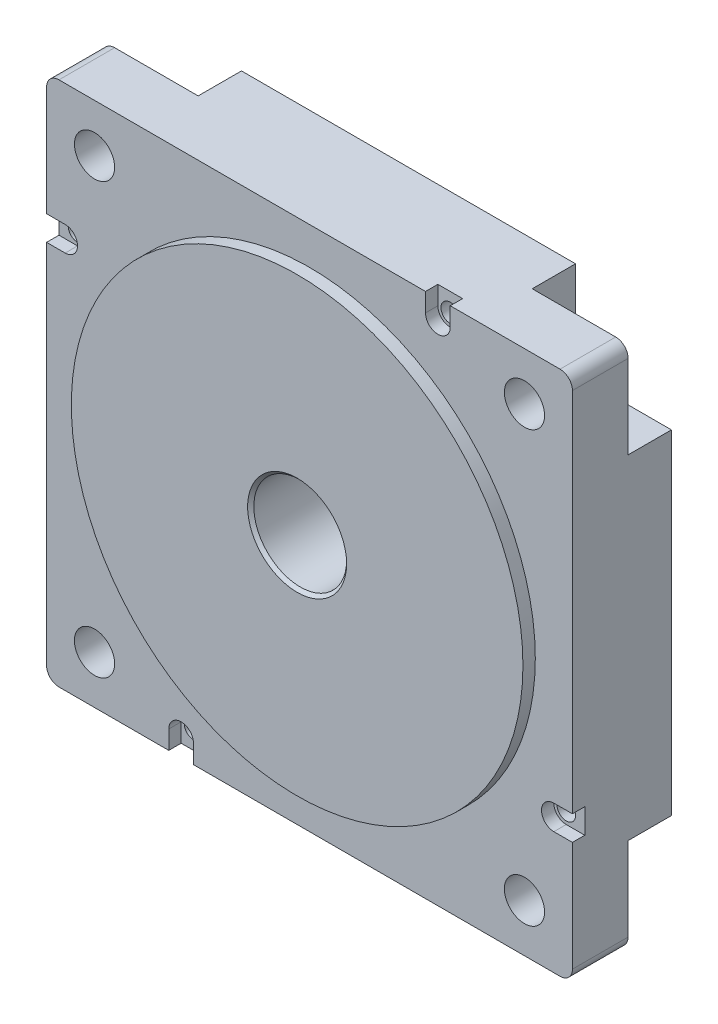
from build123d import *

# Parameters (mm, degrees)
SKETCH_1_R                       = 3.25
EXTRUDE_1_DEPTH                  = 16
CUT_EXTRUDE_1_DEPTH              = 2
SKETCH_3_R                       = 1.5
CUT_EXTRUDE_2_DEPTH              = 63.197266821
SKETCH_4_R                       = 7.5
CUT_EXTRUDE_3_DEPTH              = 63.197266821
EXTRUDE_START                    = 2
SKETCH_5_R                       = 36.5
SKETCH_5_R_2                     = 7.5
EXTRUDE_2_DEPTH                  = 2
SKETCH_6_W                       = 15.5
SKETCH_6_H                       = 15.5
CUT_EXTRUDE_4_DEPTH              = 7
CHAMFER_1_SIZE                   = 0.5
FILLET_1_R                       = 5
FILLET_2_R                       = 2
PATTERN_CIRCULAR_1_COUNT         = 4
FILLET_1_OF_PATTERN_CIRCULAR_1_R = 5


with BuildPart() as part:
    # Sketch 1 → Extrude 1 (new body)
    with BuildSketch(Plane.XY):
        Polygon((42.5, -37.5), (42.5, -42.5), (37.5, -42.5), (-37.5, -42.5), (-42.5, -42.5), (-42.5, -37.5), (-42.5, 37.5), (-42.5, 42.5), (-37.5, 42.5), (37.5, 42.5), (42.5, 42.5), (42.5, 37.5), align=None)
        with Locations((-34.75, 34.75)):
            Circle(SKETCH_1_R, mode=Mode.SUBTRACT)
        with Locations((-34.75, -34.75)):
            Circle(SKETCH_1_R, mode=Mode.SUBTRACT)
        with Locations((34.75, -34.75)):
            Circle(SKETCH_1_R, mode=Mode.SUBTRACT)
        with Locations((34.75, 34.75)):
            Circle(SKETCH_1_R, mode=Mode.SUBTRACT)
    extrude(amount=EXTRUDE_1_DEPTH)

    # Sketch 2 → Cut-Extrude 1 (cut)
    with BuildSketch(Plane.XY.offset(16)):
        with BuildLine():
            Line((-42.5, 22.75), (-39.5, 22.75))
            ThreePointArc((-39.5, 22.75), (-37.5, 20.75), (-39.5, 18.75))
            Line((-39.5, 18.75), (-42.5, 18.75))
            Line((-42.5, 18.75), (-42.5, 22.75))
        make_face()
        with BuildLine():
            Line((-22.75, -42.5), (-22.75, -39.5))
            ThreePointArc((-22.75, -39.5), (-20.75, -37.5), (-18.75, -39.5))
            Line((-18.75, -39.5), (-18.75, -42.5))
            Line((-18.75, -42.5), (-22.75, -42.5))
        make_face()
        with BuildLine():
            Line((42.5, -22.75), (39.5, -22.75))
            ThreePointArc((39.5, -22.75), (37.5, -20.75), (39.5, -18.75))
            Line((39.5, -18.75), (42.5, -18.75))
            Line((42.5, -18.75), (42.5, -22.75))
        make_face()
        with BuildLine():
            Line((22.75, 42.5), (22.75, 39.5))
            ThreePointArc((22.75, 39.5), (20.75, 37.5), (18.75, 39.5))
            Line((18.75, 39.5), (18.75, 42.5))
            Line((18.75, 42.5), (22.75, 42.5))
        make_face()
    extrude(amount=-CUT_EXTRUDE_1_DEPTH, mode=Mode.SUBTRACT)

    # Sketch 3 → Cut-Extrude 2 (cut, through all)
    with BuildSketch(Plane.XY.offset(16)):
        with Locations((-39.5, 20.75)):
            Circle(SKETCH_3_R)
        with Locations((-20.75, -39.5)):
            Circle(SKETCH_3_R)
        with Locations((39.5, -20.75)):
            Circle(SKETCH_3_R)
        with Locations((20.75, 39.5)):
            Circle(SKETCH_3_R)
    extrude(amount=-CUT_EXTRUDE_2_DEPTH, mode=Mode.SUBTRACT)

    # Sketch 4 → Cut-Extrude 3 (cut, through all)
    with BuildSketch(Plane.XY.offset(16)):
        Circle(SKETCH_4_R)
    extrude(amount=-CUT_EXTRUDE_3_DEPTH, mode=Mode.SUBTRACT)

    # Sketch 5 → Extrude 2 (add)
    with BuildSketch(Plane.XY.offset(16).offset(EXTRUDE_START)):
        Circle(SKETCH_5_R)
        Circle(SKETCH_5_R_2, mode=Mode.SUBTRACT)
    extrude(amount=-EXTRUDE_2_DEPTH)

    # Sketch 6 → Cut-Extrude 4 (cut)
    with BuildSketch(Plane(origin=(0, 0, 0), x_dir=(-1, 0, 0), z_dir=(0, 0, -1))):
        with Locations((-34.75, 34.75)):
            Rectangle(SKETCH_6_W, SKETCH_6_H)
    cut_extrude_4 = extrude(amount=-CUT_EXTRUDE_4_DEPTH, mode=Mode.SUBTRACT)

    # Chamfer 1
    chamfer_1_edges = [part.edges().sort_by_distance(p)[0] for p in [
        (-7.5, 0, 0),
        (-7.5, 0, 18),
    ]]
    chamfer(chamfer_1_edges, length=CHAMFER_1_SIZE)

    # Fillet 1
    fillet_1_edges = [part.edges().sort_by_distance(p)[0] for p in [
        (27, 27, 3.5),
    ]]
    fillet(fillet_1_edges, radius=FILLET_1_R)

    # Fillet 2
    fillet_2_edges = [part.edges().sort_by_distance(p)[0] for p in [
        (-42.5, 42.5, 8),
        (42.5, 42.5, 11.5),
        (42.5, -42.5, 8),
        (-42.5, -42.5, 8),
    ]]
    fillet(fillet_2_edges, radius=FILLET_2_R)

    # Pattern Circular 1: Cut-Extrude 4 ×4 about axis
    pattern_circular_1_axis = Axis((0, 0, 0), (0, 0, 1))
    for i in range(1, PATTERN_CIRCULAR_1_COUNT):
        add(cut_extrude_4.rotate(pattern_circular_1_axis, i * 360 / PATTERN_CIRCULAR_1_COUNT), mode=Mode.SUBTRACT)

    # Fillet 1 of Pattern Circular 1
    fillet_1_of_pattern_circular_1_edges = [part.edges().sort_by_distance(p)[0] for p in [
        (-27, 27, 3.5),
        (-27, -27, 3.5),
        (27, -27, 3.5),
    ]]
    fillet(fillet_1_of_pattern_circular_1_edges, radius=FILLET_1_OF_PATTERN_CIRCULAR_1_R)


solid = part.part
